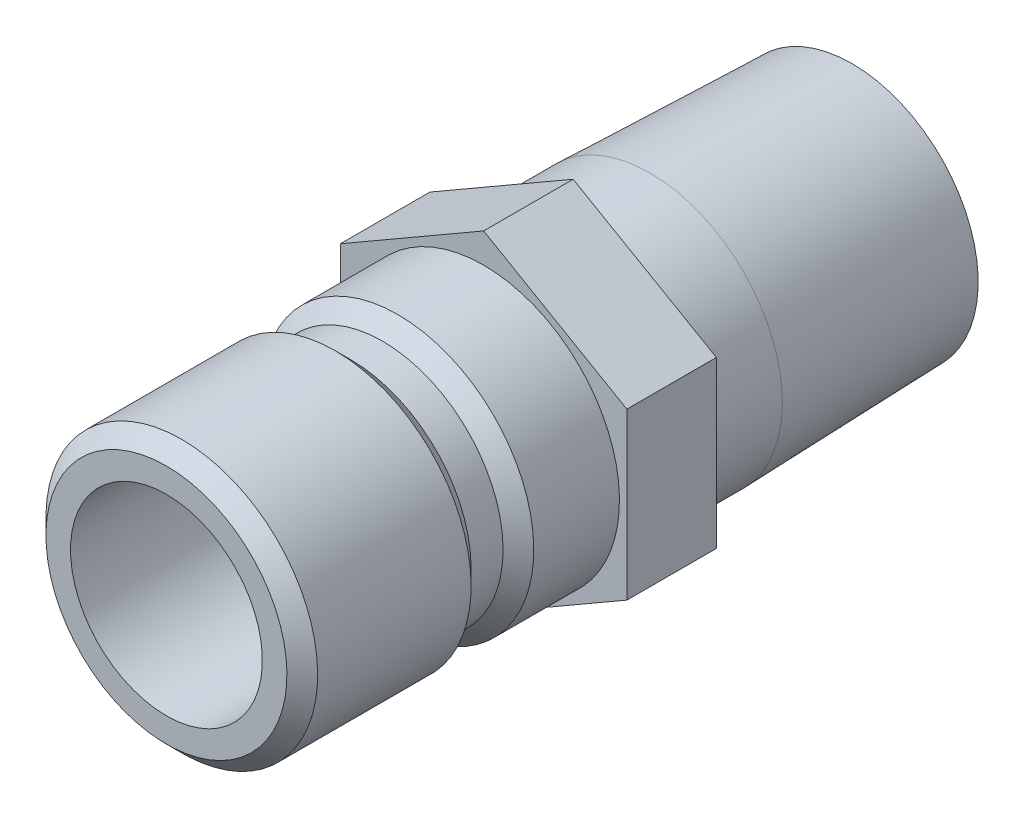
from build123d import *

# Parameters (mm, degrees)
SKETCH2_R           = 4.6228
BOSS_EXTRUDE1_DEPTH = 4.445


with BuildPart() as part:
    # Sketch1 → Revolve1 (revolve)
    with BuildSketch(Plane(origin=(0, 0, 0), x_dir=(0, 0, -1), z_dir=(1, 0, 0))):
        Polygon((-15.748, 4.7625), (-15.748, 5.9817), (-14.986, 6.7437), (-7.366, 6.7437), (-6.604, 5.9817), (-5.0165, 5.9817), (-4.2545, 6.7437), (0, 6.7437), (0, 6.5786), (8.255, 6.5786), (18.288, 6.265070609), (18.288, 4.6228), (-3.481720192, 4.6228), (-3.556, 4.7625), align=None)
    revolve(axis=Axis((0, 0, 0), (0, 0, 1)))

    # Sketch2 → Boss-Extrude1 (add)
    with BuildSketch(Plane.XY):
        Polygon((-7.112, 4.106115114), (-7.112, -4.106115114), (0, -8.212230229), (7.112, -4.106115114), (7.112, 4.106115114), (0, 8.212230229), align=None)
        with Locations(Location((0, 0, 0), (0, 0, 90))):
            Circle(SKETCH2_R, mode=Mode.SUBTRACT)
    extrude(amount=-BOSS_EXTRUDE1_DEPTH)


solid = part.part
